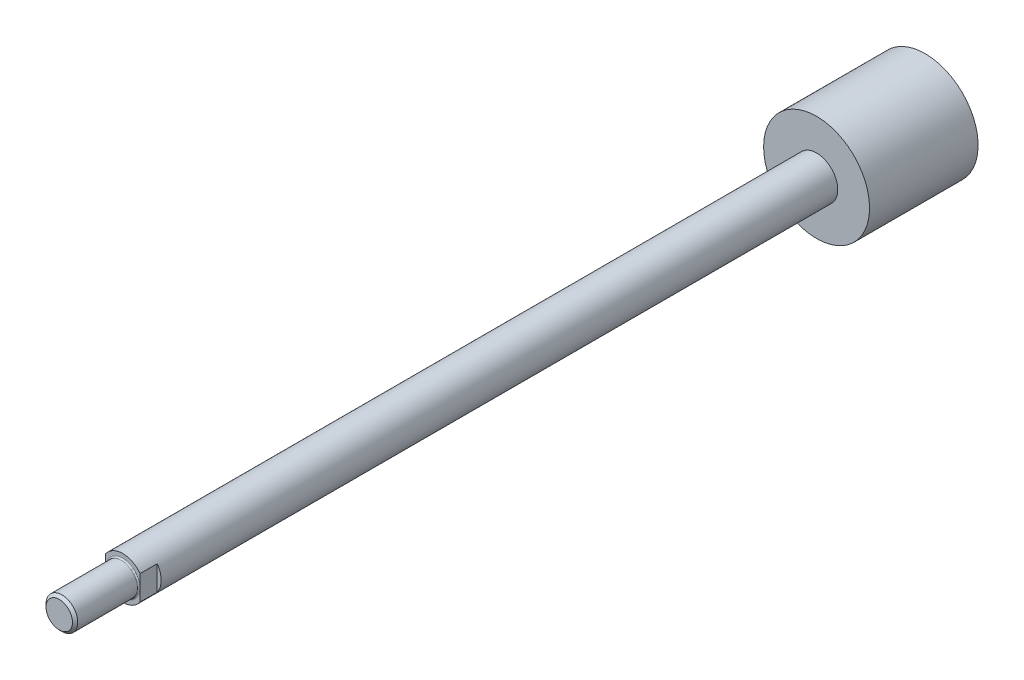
ISO-10303-21;
HEADER;
FILE_DESCRIPTION(('STEP AP214'),'2;1');
FILE_NAME('part.step','',(''),(''),'','','');
FILE_SCHEMA(('AUTOMOTIVE_DESIGN { 1 0 10303 214 1 1 1 1 }'));
ENDSEC;
DATA;
#1=APPLICATION_CONTEXT('core data for automotive mechanical design processes');
#2=APPLICATION_PROTOCOL_DEFINITION('international standard','automotive_design',2000,#1);
#3=PRODUCT_CONTEXT('',#1,'mechanical');
#4=PRODUCT('Part','Part','',(#3));
#5=PRODUCT_RELATED_PRODUCT_CATEGORY('part','',(#4));
#6=PRODUCT_DEFINITION_FORMATION('','',#4);
#7=PRODUCT_DEFINITION_CONTEXT('part definition',#1,'design');
#8=PRODUCT_DEFINITION('design','',#6,#7);
#9=PRODUCT_DEFINITION_SHAPE('','',#8);
#10=(LENGTH_UNIT() NAMED_UNIT(*) SI_UNIT(.MILLI.,.METRE.));
#11=(NAMED_UNIT(*) PLANE_ANGLE_UNIT() SI_UNIT($,.RADIAN.));
#12=(NAMED_UNIT(*) SI_UNIT($,.STERADIAN.) SOLID_ANGLE_UNIT());
#13=UNCERTAINTY_MEASURE_WITH_UNIT(LENGTH_MEASURE(1.E-05),#10,'distance_accuracy_value','');
#14=(GEOMETRIC_REPRESENTATION_CONTEXT(3) GLOBAL_UNCERTAINTY_ASSIGNED_CONTEXT((#13)) GLOBAL_UNIT_ASSIGNED_CONTEXT((#10,
#11,#12)) REPRESENTATION_CONTEXT('',''));
#15=CARTESIAN_POINT('',(0.,0.,0.));
#16=DIRECTION('',(0.,0.,1.));
#17=DIRECTION('',(1.,0.,0.));
#18=AXIS2_PLACEMENT_3D('',#15,#16,#17);
#19=CARTESIAN_POINT('',(0.,0.,327.));
#20=DIRECTION('',(0.,0.,1.));
#21=DIRECTION('',(1.,0.,0.));
#22=AXIS2_PLACEMENT_3D('',#19,#20,#21);
#23=PLANE('',#22);
#24=CARTESIAN_POINT('',(0.,0.,327.000000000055));
#25=DIRECTION('',(0.,0.,-1.));
#26=DIRECTION('',(-1.,0.,0.));
#27=AXIS2_PLACEMENT_3D('',#24,#25,#26);
#28=CIRCLE('',#27,4.99999999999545);
#29=CARTESIAN_POINT('',(-4.99999999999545,0.,327.000000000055));
#30=VERTEX_POINT('',#29);
#31=EDGE_CURVE('E102',#30,#30,#28,.T.);
#32=ORIENTED_EDGE('',*,*,#31,.F.);
#33=EDGE_LOOP('',(#32));
#34=FACE_BOUND('',#33,.T.);
#35=ADVANCED_FACE('F16',(#34),#23,.T.);
#36=CARTESIAN_POINT('',(0.,0.,326.000000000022));
#37=DIRECTION('',(0.,0.,-1.));
#38=DIRECTION('',(-1.,0.,0.));
#39=AXIS2_PLACEMENT_3D('',#36,#37,#38);
#40=CONICAL_SURFACE('',#39,5.99999999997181,0.785398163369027);
#41=CARTESIAN_POINT('',(0.,0.,326.));
#42=DIRECTION('',(0.,0.,-1.));
#43=DIRECTION('',(-1.,0.,0.));
#44=AXIS2_PLACEMENT_3D('',#41,#42,#43);
#45=CIRCLE('',#44,6.);
#46=CARTESIAN_POINT('',(-6.,0.,326.));
#47=VERTEX_POINT('',#46);
#48=EDGE_CURVE('E99',#47,#47,#45,.T.);
#49=ORIENTED_EDGE('',*,*,#48,.F.);
#50=EDGE_LOOP('',(#49));
#51=FACE_BOUND('',#50,.T.);
#52=ORIENTED_EDGE('',*,*,#31,.T.);
#53=EDGE_LOOP('',(#52));
#54=FACE_BOUND('',#53,.T.);
#55=ADVANCED_FACE('F263',(#51,#54),#40,.T.);
#56=CARTESIAN_POINT('',(0.,0.,0.));
#57=DIRECTION('',(0.,0.,-1.));
#58=DIRECTION('',(-1.,0.,0.));
#59=AXIS2_PLACEMENT_3D('',#56,#57,#58);
#60=PLANE('',#59);
#61=CARTESIAN_POINT('',(0.,0.,0.));
#62=DIRECTION('',(0.,0.,-1.));
#63=DIRECTION('',(-1.,0.,0.));
#64=AXIS2_PLACEMENT_3D('',#61,#62,#63);
#65=CIRCLE('',#64,20.);
#66=CARTESIAN_POINT('',(-20.,0.,0.));
#67=VERTEX_POINT('',#66);
#68=EDGE_CURVE('E98',#67,#67,#65,.F.);
#69=ORIENTED_EDGE('',*,*,#68,.F.);
#70=EDGE_LOOP('',(#69));
#71=FACE_BOUND('',#70,.T.);
#72=ADVANCED_FACE('F256',(#71),#60,.T.);
#73=CARTESIAN_POINT('',(0.,0.,327.));
#74=DIRECTION('',(0.,0.,-1.));
#75=DIRECTION('',(-1.,0.,0.));
#76=AXIS2_PLACEMENT_3D('',#73,#74,#75);
#77=CYLINDRICAL_SURFACE('',#76,6.);
#78=CARTESIAN_POINT('',(0.,0.,303.5));
#79=DIRECTION('',(0.,0.,1.));
#80=DIRECTION('',(1.,0.,0.));
#81=AXIS2_PLACEMENT_3D('',#78,#79,#80);
#82=CIRCLE('',#81,6.);
#83=CARTESIAN_POINT('',(6.,0.,303.5));
#84=VERTEX_POINT('',#83);
#85=EDGE_CURVE('E95',#84,#84,#82,.T.);
#86=ORIENTED_EDGE('',*,*,#85,.T.);
#87=EDGE_LOOP('',(#86));
#88=FACE_BOUND('',#87,.T.);
#89=ORIENTED_EDGE('',*,*,#48,.T.);
#90=EDGE_LOOP('',(#89));
#91=FACE_BOUND('',#90,.T.);
#92=ADVANCED_FACE('F249',(#88,#91),#77,.T.);
#93=CARTESIAN_POINT('',(0.,0.,-31.0732569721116));
#94=DIRECTION('',(0.,0.,-1.));
#95=DIRECTION('',(-1.,0.,0.));
#96=AXIS2_PLACEMENT_3D('',#93,#94,#95);
#97=CYLINDRICAL_SURFACE('',#96,20.);
#98=CARTESIAN_POINT('',(0.,0.,41.));
#99=DIRECTION('',(0.,0.,-1.));
#100=DIRECTION('',(-1.,0.,0.));
#101=AXIS2_PLACEMENT_3D('',#98,#99,#100);
#102=CIRCLE('',#101,20.);
#103=CARTESIAN_POINT('',(-20.,0.,41.));
#104=VERTEX_POINT('',#103);
#105=EDGE_CURVE('E74',#104,#104,#102,.F.);
#106=ORIENTED_EDGE('',*,*,#105,.F.);
#107=EDGE_LOOP('',(#106));
#108=FACE_BOUND('',#107,.T.);
#109=ORIENTED_EDGE('',*,*,#68,.T.);
#110=EDGE_LOOP('',(#109));
#111=FACE_BOUND('',#110,.T.);
#112=ADVANCED_FACE('F154',(#108,#111),#97,.T.);
#113=CARTESIAN_POINT('',(0.,0.,303.5));
#114=DIRECTION('',(0.,0.,1.));
#115=DIRECTION('',(1.,0.,0.));
#116=AXIS2_PLACEMENT_3D('',#113,#114,#115);
#117=TOROIDAL_SURFACE('',#116,6.5,0.5);
#118=ORIENTED_EDGE('',*,*,#85,.F.);
#119=EDGE_LOOP('',(#118));
#120=FACE_BOUND('',#119,.T.);
#121=CARTESIAN_POINT('',(0.,0.,303.));
#122=DIRECTION('',(0.,0.,1.));
#123=DIRECTION('',(-1.,0.,0.));
#124=AXIS2_PLACEMENT_3D('',#121,#122,#123);
#125=CIRCLE('',#124,6.5);
#126=CARTESIAN_POINT('',(6.5,0.,303.));
#127=VERTEX_POINT('',#126);
#128=CARTESIAN_POINT('',(-6.5,0.,303.));
#129=VERTEX_POINT('',#128);
#130=EDGE_CURVE('E81',#127,#129,#125,.F.);
#131=ORIENTED_EDGE('',*,*,#130,.F.);
#132=CARTESIAN_POINT('',(0.,0.,303.));
#133=DIRECTION('',(0.,0.,1.));
#134=DIRECTION('',(1.,0.,0.));
#135=AXIS2_PLACEMENT_3D('',#132,#133,#134);
#136=CIRCLE('',#135,6.5);
#137=EDGE_CURVE('E119',#129,#127,#136,.F.);
#138=ORIENTED_EDGE('',*,*,#137,.F.);
#139=EDGE_LOOP('',(#131,#138));
#140=FACE_BOUND('',#139,.T.);
#141=ADVANCED_FACE('F118',(#120,#140),#117,.F.);
#142=CARTESIAN_POINT('',(0.,0.,303.));
#143=DIRECTION('',(0.,0.,1.));
#144=DIRECTION('',(1.,0.,0.));
#145=AXIS2_PLACEMENT_3D('',#142,#143,#144);
#146=PLANE('',#145);
#147=DIRECTION('',(0.,1.,0.));
#148=VECTOR('',#147,1.);
#149=CARTESIAN_POINT('',(-6.5,4.66368952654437,303.));
#150=LINE('',#149,#148);
#151=CARTESIAN_POINT('',(-6.5,-4.66368952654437,303.));
#152=VERTEX_POINT('',#151);
#153=EDGE_CURVE('E78',#129,#152,#150,.F.);
#154=ORIENTED_EDGE('',*,*,#153,.T.);
#155=CARTESIAN_POINT('',(0.,0.,303.));
#156=DIRECTION('',(0.,0.,-1.));
#157=DIRECTION('',(-1.,0.,0.));
#158=AXIS2_PLACEMENT_3D('',#155,#156,#157);
#159=CIRCLE('',#158,7.99999999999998);
#160=CARTESIAN_POINT('',(6.5,-4.66368952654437,303.));
#161=VERTEX_POINT('',#160);
#162=EDGE_CURVE('E61',#161,#152,#159,.T.);
#163=ORIENTED_EDGE('',*,*,#162,.F.);
#164=DIRECTION('',(0.,1.,0.));
#165=VECTOR('',#164,1.);
#166=CARTESIAN_POINT('',(6.5,-4.66368952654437,303.));
#167=LINE('',#166,#165);
#168=EDGE_CURVE('E122',#161,#127,#167,.T.);
#169=ORIENTED_EDGE('',*,*,#168,.T.);
#170=ORIENTED_EDGE('',*,*,#130,.T.);
#171=EDGE_LOOP('',(#154,#163,#169,#170));
#172=FACE_BOUND('',#171,.T.);
#173=ADVANCED_FACE('F79',(#172),#146,.T.);
#174=CARTESIAN_POINT('',(0.,0.,296.5));
#175=DIRECTION('',(0.,0.,1.));
#176=DIRECTION('',(1.,0.,0.));
#177=AXIS2_PLACEMENT_3D('',#174,#175,#176);
#178=PLANE('',#177);
#179=CARTESIAN_POINT('',(0.,0.,296.5));
#180=DIRECTION('',(0.,0.,-1.));
#181=DIRECTION('',(-1.,0.,0.));
#182=AXIS2_PLACEMENT_3D('',#179,#180,#181);
#183=CIRCLE('',#182,7.99999999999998);
#184=CARTESIAN_POINT('',(6.5,4.66368952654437,296.5));
#185=VERTEX_POINT('',#184);
#186=CARTESIAN_POINT('',(6.5,-4.66368952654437,296.5));
#187=VERTEX_POINT('',#186);
#188=EDGE_CURVE('E110',#185,#187,#183,.T.);
#189=ORIENTED_EDGE('',*,*,#188,.F.);
#190=DIRECTION('',(0.,1.,0.));
#191=VECTOR('',#190,1.);
#192=CARTESIAN_POINT('',(6.5,-4.66368952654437,296.5));
#193=LINE('',#192,#191);
#194=EDGE_CURVE('E127',#185,#187,#193,.F.);
#195=ORIENTED_EDGE('',*,*,#194,.T.);
#196=EDGE_LOOP('',(#189,#195));
#197=FACE_BOUND('',#196,.T.);
#198=ADVANCED_FACE('F169',(#197),#178,.T.);
#199=CARTESIAN_POINT('',(0.,20.,41.));
#200=DIRECTION('',(0.,0.,1.));
#201=DIRECTION('',(1.,0.,0.));
#202=AXIS2_PLACEMENT_3D('',#199,#200,#201);
#203=PLANE('',#202);
#204=ORIENTED_EDGE('',*,*,#105,.T.);
#205=EDGE_LOOP('',(#204));
#206=FACE_BOUND('',#205,.T.);
#207=CARTESIAN_POINT('',(0.,0.,41.));
#208=DIRECTION('',(0.,0.,-1.));
#209=DIRECTION('',(-1.,0.,0.));
#210=AXIS2_PLACEMENT_3D('',#207,#208,#209);
#211=CIRCLE('',#210,7.99999999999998);
#212=CARTESIAN_POINT('',(-7.99999999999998,0.,41.));
#213=VERTEX_POINT('',#212);
#214=EDGE_CURVE('E107',#213,#213,#211,.F.);
#215=ORIENTED_EDGE('',*,*,#214,.F.);
#216=EDGE_LOOP('',(#215));
#217=FACE_BOUND('',#216,.T.);
#218=ADVANCED_FACE('F172',(#206,#217),#203,.T.);
#219=CARTESIAN_POINT('',(0.,0.,296.5));
#220=DIRECTION('',(0.,0.,1.));
#221=DIRECTION('',(1.,0.,0.));
#222=AXIS2_PLACEMENT_3D('',#219,#220,#221);
#223=PLANE('',#222);
#224=CARTESIAN_POINT('',(0.,0.,296.5));
#225=DIRECTION('',(0.,0.,-1.));
#226=DIRECTION('',(-1.,0.,0.));
#227=AXIS2_PLACEMENT_3D('',#224,#225,#226);
#228=CIRCLE('',#227,7.99999999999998);
#229=CARTESIAN_POINT('',(-6.5,-4.66368952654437,296.5));
#230=VERTEX_POINT('',#229);
#231=CARTESIAN_POINT('',(-6.5,4.66368952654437,296.5));
#232=VERTEX_POINT('',#231);
#233=EDGE_CURVE('E105',#230,#232,#228,.T.);
#234=ORIENTED_EDGE('',*,*,#233,.F.);
#235=DIRECTION('',(0.,1.,0.));
#236=VECTOR('',#235,1.);
#237=CARTESIAN_POINT('',(-6.5,4.66368952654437,296.5));
#238=LINE('',#237,#236);
#239=EDGE_CURVE('E86',#230,#232,#238,.T.);
#240=ORIENTED_EDGE('',*,*,#239,.T.);
#241=EDGE_LOOP('',(#234,#240));
#242=FACE_BOUND('',#241,.T.);
#243=ADVANCED_FACE('F176',(#242),#223,.T.);
#244=CARTESIAN_POINT('',(-6.5,4.66368952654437,296.5));
#245=DIRECTION('',(1.,0.,0.));
#246=DIRECTION('',(0.,0.,-1.));
#247=AXIS2_PLACEMENT_3D('',#244,#245,#246);
#248=PLANE('',#247);
#249=DIRECTION('',(0.,1.,0.));
#250=VECTOR('',#249,1.);
#251=CARTESIAN_POINT('',(-6.5,0.,303.));
#252=LINE('',#251,#250);
#253=CARTESIAN_POINT('',(-6.5,4.66368952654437,303.));
#254=VERTEX_POINT('',#253);
#255=EDGE_CURVE('E85',#254,#129,#252,.F.);
#256=ORIENTED_EDGE('',*,*,#255,.F.);
#257=DIRECTION('',(0.,0.,-1.));
#258=VECTOR('',#257,1.);
#259=CARTESIAN_POINT('',(-6.5,4.66368952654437,-31.0732569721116));
#260=LINE('',#259,#258);
#261=EDGE_CURVE('E104',#232,#254,#260,.F.);
#262=ORIENTED_EDGE('',*,*,#261,.F.);
#263=ORIENTED_EDGE('',*,*,#239,.F.);
#264=DIRECTION('',(0.,0.,-1.));
#265=VECTOR('',#264,1.);
#266=CARTESIAN_POINT('',(-6.5,-4.66368952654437,296.5));
#267=LINE('',#266,#265);
#268=EDGE_CURVE('E66',#152,#230,#267,.T.);
#269=ORIENTED_EDGE('',*,*,#268,.F.);
#270=ORIENTED_EDGE('',*,*,#153,.F.);
#271=EDGE_LOOP('',(#256,#262,#263,#269,#270));
#272=FACE_BOUND('',#271,.T.);
#273=ADVANCED_FACE('F88',(#272),#248,.F.);
#274=CARTESIAN_POINT('',(0.,0.,303.));
#275=DIRECTION('',(0.,0.,1.));
#276=DIRECTION('',(1.,0.,0.));
#277=AXIS2_PLACEMENT_3D('',#274,#275,#276);
#278=PLANE('',#277);
#279=DIRECTION('',(0.,1.,0.));
#280=VECTOR('',#279,1.);
#281=CARTESIAN_POINT('',(6.5,-4.66368952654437,303.));
#282=LINE('',#281,#280);
#283=CARTESIAN_POINT('',(6.5,4.66368952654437,303.));
#284=VERTEX_POINT('',#283);
#285=EDGE_CURVE('E37',#127,#284,#282,.T.);
#286=ORIENTED_EDGE('',*,*,#285,.T.);
#287=CARTESIAN_POINT('',(0.,0.,303.));
#288=DIRECTION('',(0.,0.,-1.));
#289=DIRECTION('',(-1.,0.,0.));
#290=AXIS2_PLACEMENT_3D('',#287,#288,#289);
#291=CIRCLE('',#290,7.99999999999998);
#292=EDGE_CURVE('E28',#254,#284,#291,.T.);
#293=ORIENTED_EDGE('',*,*,#292,.F.);
#294=ORIENTED_EDGE('',*,*,#255,.T.);
#295=ORIENTED_EDGE('',*,*,#137,.T.);
#296=EDGE_LOOP('',(#286,#293,#294,#295));
#297=FACE_BOUND('',#296,.T.);
#298=ADVANCED_FACE('F126',(#297),#278,.T.);
#299=CARTESIAN_POINT('',(6.5,-4.66368952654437,296.5));
#300=DIRECTION('',(-1.,0.,0.));
#301=DIRECTION('',(0.,0.,1.));
#302=AXIS2_PLACEMENT_3D('',#299,#300,#301);
#303=PLANE('',#302);
#304=ORIENTED_EDGE('',*,*,#168,.F.);
#305=DIRECTION('',(0.,0.,1.));
#306=VECTOR('',#305,1.);
#307=CARTESIAN_POINT('',(6.5,-4.66368952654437,296.5));
#308=LINE('',#307,#306);
#309=EDGE_CURVE('E70',#187,#161,#308,.T.);
#310=ORIENTED_EDGE('',*,*,#309,.F.);
#311=ORIENTED_EDGE('',*,*,#194,.F.);
#312=DIRECTION('',(0.,0.,-1.));
#313=VECTOR('',#312,1.);
#314=CARTESIAN_POINT('',(6.5,4.66368952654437,-31.0732569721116));
#315=LINE('',#314,#313);
#316=EDGE_CURVE('E11',#284,#185,#315,.T.);
#317=ORIENTED_EDGE('',*,*,#316,.F.);
#318=ORIENTED_EDGE('',*,*,#285,.F.);
#319=EDGE_LOOP('',(#304,#310,#311,#317,#318));
#320=FACE_BOUND('',#319,.T.);
#321=ADVANCED_FACE('F130',(#320),#303,.F.);
#322=CARTESIAN_POINT('',(0.,0.,-31.0732569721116));
#323=DIRECTION('',(0.,0.,-1.));
#324=DIRECTION('',(-1.,0.,0.));
#325=AXIS2_PLACEMENT_3D('',#322,#323,#324);
#326=CYLINDRICAL_SURFACE('',#325,7.99999999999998);
#327=ORIENTED_EDGE('',*,*,#214,.T.);
#328=EDGE_LOOP('',(#327));
#329=FACE_BOUND('',#328,.T.);
#330=ORIENTED_EDGE('',*,*,#292,.T.);
#331=ORIENTED_EDGE('',*,*,#316,.T.);
#332=ORIENTED_EDGE('',*,*,#188,.T.);
#333=ORIENTED_EDGE('',*,*,#309,.T.);
#334=ORIENTED_EDGE('',*,*,#162,.T.);
#335=ORIENTED_EDGE('',*,*,#268,.T.);
#336=ORIENTED_EDGE('',*,*,#233,.T.);
#337=ORIENTED_EDGE('',*,*,#261,.T.);
#338=EDGE_LOOP('',(#330,#331,#332,#333,#334,#335,#336,#337));
#339=FACE_BOUND('',#338,.T.);
#340=ADVANCED_FACE('F18',(#329,#339),#326,.T.);
#341=CLOSED_SHELL('',(#35,#55,#72,#92,#112,#141,#173,#198,#218,#243,#273,#298,#321,#340));
#342=MANIFOLD_SOLID_BREP('B1',#341);
#343=ADVANCED_BREP_SHAPE_REPRESENTATION('',(#18,#342),#14);
#344=SHAPE_DEFINITION_REPRESENTATION(#9,#343);
ENDSEC;
END-ISO-10303-21;
